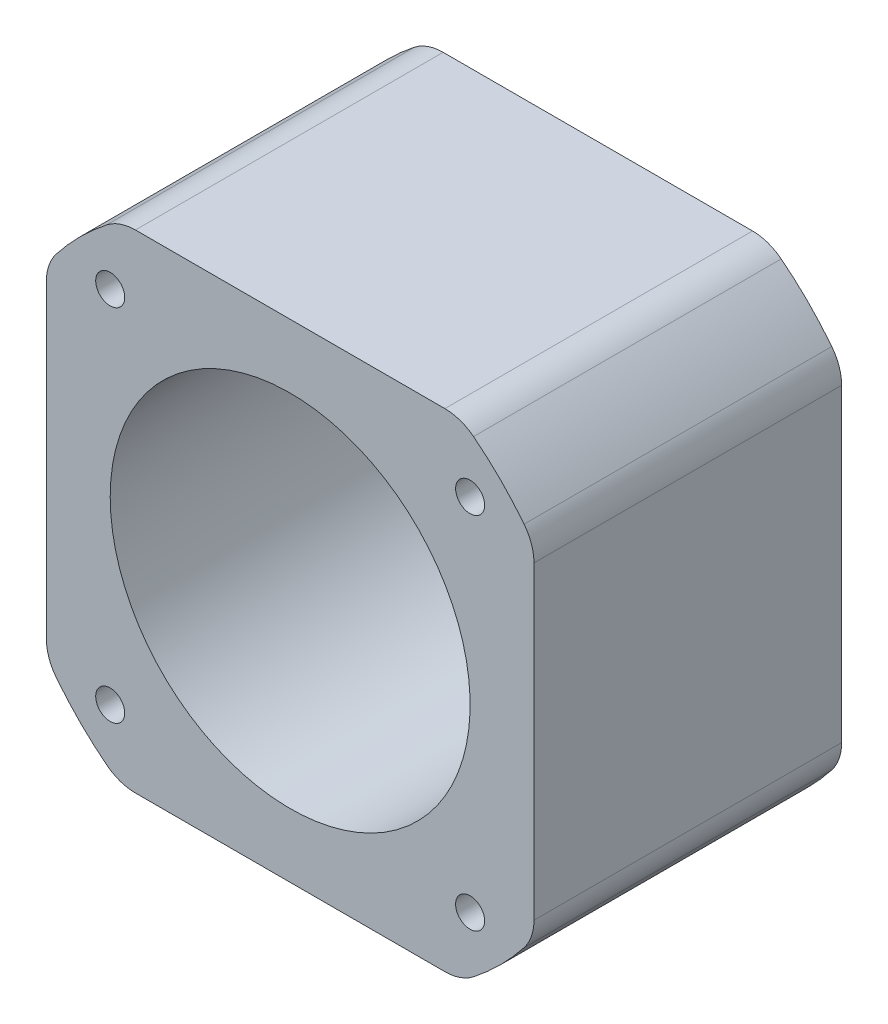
from build123d import *

# Parameters (mm, degrees)
SKETCH1_R           = 1.25
SKETCH1_R_2         = 15.5
BOSS_EXTRUDE1_DEPTH = 26.5


with BuildPart() as part:
    # Sketch1 → Boss-Extrude1 (new body)
    with BuildSketch(Plane.XY.offset(34.2)):
        with BuildLine():
            Line((-31.395502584, 117.942315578), (-31.395502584, 91.291987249))
            ThreePointArc((-31.395502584, 91.291987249), (-31.176546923, 89.986727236), (-30.543650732, 88.824364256))
            ThreePointArc((-30.543650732, 88.824364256), (-28.497436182, 86.515217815), (-26.188289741, 84.469003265))
            ThreePointArc((-26.188289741, 84.469003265), (-25.025926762, 83.836107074), (-23.720666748, 83.617151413))
            Line((-23.720666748, 83.617151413), (2.92966158, 83.617151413))
            ThreePointArc((2.92966158, 83.617151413), (4.234921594, 83.836107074), (5.397284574, 84.469003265))
            ThreePointArc((5.397284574, 84.469003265), (7.706431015, 86.515217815), (9.752645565, 88.824364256))
            ThreePointArc((9.752645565, 88.824364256), (10.385541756, 89.986727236), (10.604497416, 91.291987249))
            Line((10.604497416, 91.291987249), (10.604497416, 117.942315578))
            ThreePointArc((10.604497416, 117.942315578), (10.385541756, 119.247575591), (9.752645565, 120.409938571))
            ThreePointArc((9.752645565, 120.409938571), (7.706431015, 122.719085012), (5.397284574, 124.765299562))
            ThreePointArc((5.397284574, 124.765299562), (4.234921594, 125.398195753), (2.92966158, 125.617151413))
            Line((2.92966158, 125.617151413), (-23.720666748, 125.617151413))
            ThreePointArc((-23.720666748, 125.617151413), (-25.025926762, 125.398195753), (-26.188289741, 124.765299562))
            ThreePointArc((-26.188289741, 124.765299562), (-28.497436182, 122.719085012), (-30.543650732, 120.409938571))
            ThreePointArc((-30.543650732, 120.409938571), (-31.176546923, 119.247575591), (-31.395502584, 117.942315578))
        make_face()
        with Locations(Location((5.104497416, 89.117151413, 0), (0, 0, 180))):
            Circle(SKETCH1_R, mode=Mode.SUBTRACT)
        with Locations(Location((-25.895502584, 120.117151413, 0), (0, 0, 180))):
            Circle(SKETCH1_R, mode=Mode.SUBTRACT)
        with Locations(Location((-10.395502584, 104.617151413, 0), (0, 0, 180))):
            Circle(SKETCH1_R_2, mode=Mode.SUBTRACT)
        with Locations(Location((5.104497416, 120.117151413, 0), (0, 0, 180))):
            Circle(SKETCH1_R, mode=Mode.SUBTRACT)
        with Locations(Location((-25.895502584, 89.117151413, 0), (0, 0, 180))):
            Circle(SKETCH1_R, mode=Mode.SUBTRACT)
    extrude(amount=-BOSS_EXTRUDE1_DEPTH)


solid = part.part
